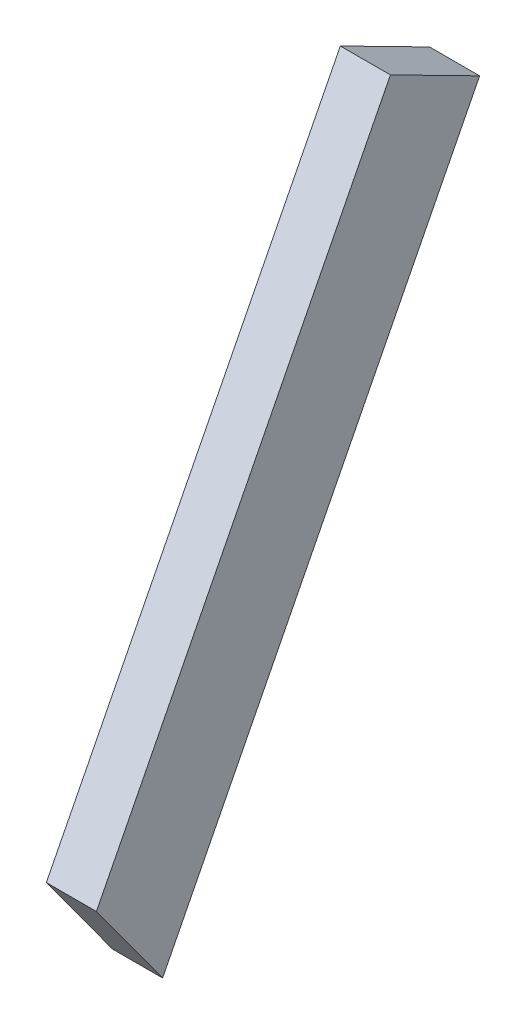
ISO-10303-21;
HEADER;
FILE_DESCRIPTION(('STEP AP214'),'2;1');
FILE_NAME('part.step','',(''),(''),'','','');
FILE_SCHEMA(('AUTOMOTIVE_DESIGN { 1 0 10303 214 1 1 1 1 }'));
ENDSEC;
DATA;
#1=APPLICATION_CONTEXT('core data for automotive mechanical design processes');
#2=APPLICATION_PROTOCOL_DEFINITION('international standard','automotive_design',2000,#1);
#3=PRODUCT_CONTEXT('',#1,'mechanical');
#4=PRODUCT('Part','Part','',(#3));
#5=PRODUCT_RELATED_PRODUCT_CATEGORY('part','',(#4));
#6=PRODUCT_DEFINITION_FORMATION('','',#4);
#7=PRODUCT_DEFINITION_CONTEXT('part definition',#1,'design');
#8=PRODUCT_DEFINITION('design','',#6,#7);
#9=PRODUCT_DEFINITION_SHAPE('','',#8);
#10=(LENGTH_UNIT() NAMED_UNIT(*) SI_UNIT(.MILLI.,.METRE.));
#11=(NAMED_UNIT(*) PLANE_ANGLE_UNIT() SI_UNIT($,.RADIAN.));
#12=(NAMED_UNIT(*) SI_UNIT($,.STERADIAN.) SOLID_ANGLE_UNIT());
#13=UNCERTAINTY_MEASURE_WITH_UNIT(LENGTH_MEASURE(1.E-05),#10,'distance_accuracy_value','');
#14=(GEOMETRIC_REPRESENTATION_CONTEXT(3) GLOBAL_UNCERTAINTY_ASSIGNED_CONTEXT((#13)) GLOBAL_UNIT_ASSIGNED_CONTEXT((#10,
#11,#12)) REPRESENTATION_CONTEXT('',''));
#15=CARTESIAN_POINT('',(0.,0.,0.));
#16=DIRECTION('',(0.,0.,1.));
#17=DIRECTION('',(1.,0.,0.));
#18=AXIS2_PLACEMENT_3D('',#15,#16,#17);
#19=CARTESIAN_POINT('',(-5.,8.22724903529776,-6.55047327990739));
#20=DIRECTION('',(0.,0.589478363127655,-0.807784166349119));
#21=DIRECTION('',(0.,0.807784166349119,0.589478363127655));
#22=AXIS2_PLACEMENT_3D('',#19,#20,#21);
#23=PLANE('',#22);
#24=DIRECTION('',(0.,0.807784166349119,0.589478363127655));
#25=VECTOR('',#24,1.);
#26=CARTESIAN_POINT('',(0.,8.22724903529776,-6.55047327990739));
#27=LINE('',#26,#25);
#28=CARTESIAN_POINT('',(0.,8.22724903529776,-6.55047327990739));
#29=VERTEX_POINT('',#28);
#30=CARTESIAN_POINT('',(0.,17.28518135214,0.0595289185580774));
#31=VERTEX_POINT('',#30);
#32=EDGE_CURVE('E72',#29,#31,#27,.T.);
#33=ORIENTED_EDGE('',*,*,#32,.T.);
#34=DIRECTION('',(1.,0.,0.));
#35=VECTOR('',#34,1.);
#36=CARTESIAN_POINT('',(-5.,17.28518135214,0.0595289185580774));
#37=LINE('',#36,#35);
#38=CARTESIAN_POINT('',(-5.,17.28518135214,0.0595289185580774));
#39=VERTEX_POINT('',#38);
#40=EDGE_CURVE('E11',#39,#31,#37,.T.);
#41=ORIENTED_EDGE('',*,*,#40,.F.);
#42=DIRECTION('',(0.,0.807784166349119,0.589478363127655));
#43=VECTOR('',#42,1.);
#44=CARTESIAN_POINT('',(-5.,8.22724903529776,-6.55047327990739));
#45=LINE('',#44,#43);
#46=CARTESIAN_POINT('',(-5.,8.22724903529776,-6.55047327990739));
#47=VERTEX_POINT('',#46);
#48=EDGE_CURVE('E90',#47,#39,#45,.T.);
#49=ORIENTED_EDGE('',*,*,#48,.F.);
#50=DIRECTION('',(1.,0.,0.));
#51=VECTOR('',#50,1.);
#52=CARTESIAN_POINT('',(-5.,8.22724903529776,-6.55047327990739));
#53=LINE('',#52,#51);
#54=EDGE_CURVE('E84',#47,#29,#53,.T.);
#55=ORIENTED_EDGE('',*,*,#54,.T.);
#56=EDGE_LOOP('',(#33,#41,#49,#55));
#57=FACE_BOUND('',#56,.T.);
#58=ADVANCED_FACE('F28',(#57),#23,.F.);
#59=CARTESIAN_POINT('',(-5.,17.28518135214,0.0595289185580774));
#60=DIRECTION('',(0.,-0.453679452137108,-0.891164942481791));
#61=DIRECTION('',(0.,0.891164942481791,-0.453679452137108));
#62=AXIS2_PLACEMENT_3D('',#59,#60,#61);
#63=PLANE('',#62);
#64=DIRECTION('',(0.,0.891164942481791,-0.453679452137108));
#65=VECTOR('',#64,1.);
#66=CARTESIAN_POINT('',(0.,17.28518135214,0.0595289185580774));
#67=LINE('',#66,#65);
#68=CARTESIAN_POINT('',(0.,74.9540435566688,-29.2988721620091));
#69=VERTEX_POINT('',#68);
#70=EDGE_CURVE('E68',#31,#69,#67,.T.);
#71=ORIENTED_EDGE('',*,*,#70,.T.);
#72=DIRECTION('',(1.,0.,0.));
#73=VECTOR('',#72,1.);
#74=CARTESIAN_POINT('',(-5.,74.9540435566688,-29.2988721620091));
#75=LINE('',#74,#73);
#76=CARTESIAN_POINT('',(-5.,74.9540435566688,-29.2988721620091));
#77=VERTEX_POINT('',#76);
#78=EDGE_CURVE('E35',#77,#69,#75,.T.);
#79=ORIENTED_EDGE('',*,*,#78,.F.);
#80=DIRECTION('',(0.,0.891164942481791,-0.453679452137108));
#81=VECTOR('',#80,1.);
#82=CARTESIAN_POINT('',(-5.,17.28518135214,0.0595289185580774));
#83=LINE('',#82,#81);
#84=EDGE_CURVE('E80',#39,#77,#83,.T.);
#85=ORIENTED_EDGE('',*,*,#84,.F.);
#86=ORIENTED_EDGE('',*,*,#40,.T.);
#87=EDGE_LOOP('',(#71,#79,#85,#86));
#88=FACE_BOUND('',#87,.T.);
#89=ADVANCED_FACE('F79',(#88),#63,.F.);
#90=CARTESIAN_POINT('',(-5.,70.4172490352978,-38.210521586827));
#91=DIRECTION('',(0.,-0.891164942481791,0.453679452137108));
#92=DIRECTION('',(0.,-0.453679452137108,-0.891164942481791));
#93=AXIS2_PLACEMENT_3D('',#90,#91,#92);
#94=PLANE('',#93);
#95=DIRECTION('',(0.,-0.453679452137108,-0.891164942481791));
#96=VECTOR('',#95,1.);
#97=CARTESIAN_POINT('',(0.,70.4172490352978,-38.210521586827));
#98=LINE('',#97,#96);
#99=CARTESIAN_POINT('',(0.,70.4172490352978,-38.210521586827));
#100=VERTEX_POINT('',#99);
#101=EDGE_CURVE('E73',#69,#100,#98,.T.);
#102=ORIENTED_EDGE('',*,*,#101,.T.);
#103=DIRECTION('',(1.,0.,0.));
#104=VECTOR('',#103,1.);
#105=CARTESIAN_POINT('',(-5.,70.4172490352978,-38.210521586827));
#106=LINE('',#105,#104);
#107=CARTESIAN_POINT('',(-5.,70.4172490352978,-38.210521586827));
#108=VERTEX_POINT('',#107);
#109=EDGE_CURVE('E96',#108,#100,#106,.T.);
#110=ORIENTED_EDGE('',*,*,#109,.F.);
#111=DIRECTION('',(0.,-0.453679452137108,-0.891164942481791));
#112=VECTOR('',#111,1.);
#113=CARTESIAN_POINT('',(-5.,70.4172490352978,-38.210521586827));
#114=LINE('',#113,#112);
#115=EDGE_CURVE('E47',#77,#108,#114,.T.);
#116=ORIENTED_EDGE('',*,*,#115,.F.);
#117=ORIENTED_EDGE('',*,*,#78,.T.);
#118=EDGE_LOOP('',(#102,#110,#116,#117));
#119=FACE_BOUND('',#118,.T.);
#120=ADVANCED_FACE('F99',(#119),#94,.F.);
#121=CARTESIAN_POINT('',(-5.,8.22724903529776,-6.55047327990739));
#122=DIRECTION('',(0.,0.453679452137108,0.891164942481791));
#123=DIRECTION('',(0.,-0.891164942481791,0.453679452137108));
#124=AXIS2_PLACEMENT_3D('',#121,#122,#123);
#125=PLANE('',#124);
#126=DIRECTION('',(0.,-0.891164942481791,0.453679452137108));
#127=VECTOR('',#126,1.);
#128=CARTESIAN_POINT('',(0.,8.22724903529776,-6.55047327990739));
#129=LINE('',#128,#127);
#130=EDGE_CURVE('E88',#100,#29,#129,.T.);
#131=ORIENTED_EDGE('',*,*,#130,.T.);
#132=ORIENTED_EDGE('',*,*,#54,.F.);
#133=DIRECTION('',(0.,-0.891164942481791,0.453679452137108));
#134=VECTOR('',#133,1.);
#135=CARTESIAN_POINT('',(-5.,8.22724903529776,-6.55047327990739));
#136=LINE('',#135,#134);
#137=EDGE_CURVE('E42',#108,#47,#136,.T.);
#138=ORIENTED_EDGE('',*,*,#137,.F.);
#139=ORIENTED_EDGE('',*,*,#109,.T.);
#140=EDGE_LOOP('',(#131,#132,#138,#139));
#141=FACE_BOUND('',#140,.T.);
#142=ADVANCED_FACE('F101',(#141),#125,.F.);
#143=CARTESIAN_POINT('',(-5.,8.22724903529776,-6.55047327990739));
#144=DIRECTION('',(-1.,0.,0.));
#145=DIRECTION('',(0.,0.,1.));
#146=AXIS2_PLACEMENT_3D('',#143,#144,#145);
#147=PLANE('',#146);
#148=ORIENTED_EDGE('',*,*,#48,.T.);
#149=ORIENTED_EDGE('',*,*,#84,.T.);
#150=ORIENTED_EDGE('',*,*,#115,.T.);
#151=ORIENTED_EDGE('',*,*,#137,.T.);
#152=EDGE_LOOP('',(#148,#149,#150,#151));
#153=FACE_BOUND('',#152,.T.);
#154=ADVANCED_FACE('F102',(#153),#147,.T.);
#155=CARTESIAN_POINT('',(0.,8.22724903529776,-6.55047327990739));
#156=DIRECTION('',(-1.,0.,0.));
#157=DIRECTION('',(0.,0.,1.));
#158=AXIS2_PLACEMENT_3D('',#155,#156,#157);
#159=PLANE('',#158);
#160=ORIENTED_EDGE('',*,*,#32,.F.);
#161=ORIENTED_EDGE('',*,*,#130,.F.);
#162=ORIENTED_EDGE('',*,*,#101,.F.);
#163=ORIENTED_EDGE('',*,*,#70,.F.);
#164=EDGE_LOOP('',(#160,#161,#162,#163));
#165=FACE_BOUND('',#164,.T.);
#166=ADVANCED_FACE('F69',(#165),#159,.F.);
#167=CLOSED_SHELL('',(#58,#89,#120,#142,#154,#166));
#168=MANIFOLD_SOLID_BREP('B2',#167);
#169=ADVANCED_BREP_SHAPE_REPRESENTATION('',(#18,#168),#14);
#170=SHAPE_DEFINITION_REPRESENTATION(#9,#169);
ENDSEC;
END-ISO-10303-21;
